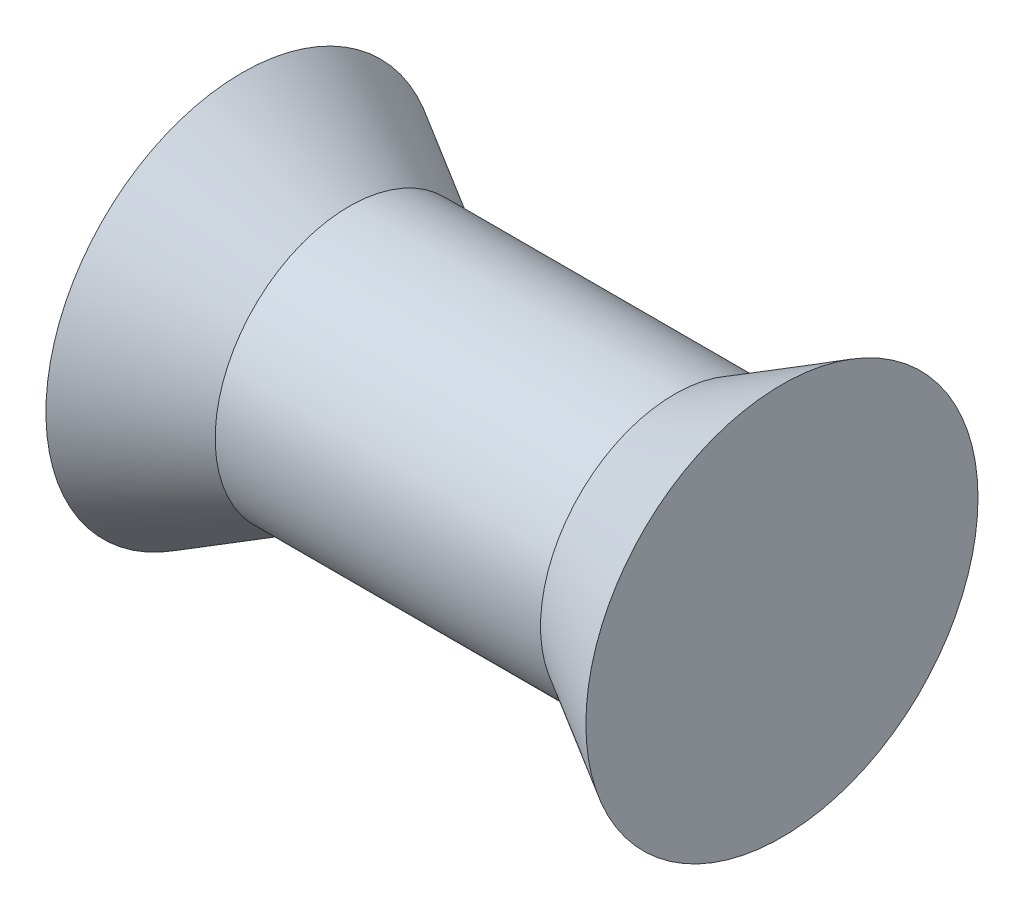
ISO-10303-21;
HEADER;
FILE_DESCRIPTION(('STEP AP214'),'2;1');
FILE_NAME('part.step','',(''),(''),'','','');
FILE_SCHEMA(('AUTOMOTIVE_DESIGN { 1 0 10303 214 1 1 1 1 }'));
ENDSEC;
DATA;
#1=APPLICATION_CONTEXT('core data for automotive mechanical design processes');
#2=APPLICATION_PROTOCOL_DEFINITION('international standard','automotive_design',2000,#1);
#3=PRODUCT_CONTEXT('',#1,'mechanical');
#4=PRODUCT('Part','Part','',(#3));
#5=PRODUCT_RELATED_PRODUCT_CATEGORY('part','',(#4));
#6=PRODUCT_DEFINITION_FORMATION('','',#4);
#7=PRODUCT_DEFINITION_CONTEXT('part definition',#1,'design');
#8=PRODUCT_DEFINITION('design','',#6,#7);
#9=PRODUCT_DEFINITION_SHAPE('','',#8);
#10=(LENGTH_UNIT() NAMED_UNIT(*) SI_UNIT(.MILLI.,.METRE.));
#11=(NAMED_UNIT(*) PLANE_ANGLE_UNIT() SI_UNIT($,.RADIAN.));
#12=(NAMED_UNIT(*) SI_UNIT($,.STERADIAN.) SOLID_ANGLE_UNIT());
#13=UNCERTAINTY_MEASURE_WITH_UNIT(LENGTH_MEASURE(1.E-05),#10,'distance_accuracy_value','');
#14=(GEOMETRIC_REPRESENTATION_CONTEXT(3) GLOBAL_UNCERTAINTY_ASSIGNED_CONTEXT((#13)) GLOBAL_UNIT_ASSIGNED_CONTEXT((#10,
#11,#12)) REPRESENTATION_CONTEXT('',''));
#15=CARTESIAN_POINT('',(0.,0.,0.));
#16=DIRECTION('',(0.,0.,1.));
#17=DIRECTION('',(1.,0.,0.));
#18=AXIS2_PLACEMENT_3D('',#15,#16,#17);
#19=CARTESIAN_POINT('',(0.,0.,0.));
#20=DIRECTION('',(1.,0.,0.));
#21=DIRECTION('',(0.,0.,-1.));
#22=AXIS2_PLACEMENT_3D('',#19,#20,#21);
#23=PLANE('',#22);
#24=CARTESIAN_POINT('',(0.,0.,0.));
#25=DIRECTION('',(1.,0.,0.));
#26=DIRECTION('',(0.,0.,-1.));
#27=AXIS2_PLACEMENT_3D('',#24,#25,#26);
#28=CIRCLE('',#27,2.87771120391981);
#29=CARTESIAN_POINT('',(0.,0.,-2.87771120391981));
#30=VERTEX_POINT('',#29);
#31=EDGE_CURVE('E10',#30,#30,#28,.T.);
#32=ORIENTED_EDGE('',*,*,#31,.T.);
#33=EDGE_LOOP('',(#32));
#34=FACE_BOUND('',#33,.T.);
#35=ADVANCED_FACE('F35',(#34),#23,.T.);
#36=CARTESIAN_POINT('',(0.,0.,0.));
#37=DIRECTION('',(1.,0.,0.));
#38=DIRECTION('',(0.,0.,-1.));
#39=AXIS2_PLACEMENT_3D('',#36,#37,#38);
#40=CONICAL_SURFACE('',#39,2.87771120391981,0.523598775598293);
#41=CARTESIAN_POINT('',(-1.5748,0.,0.));
#42=DIRECTION('',(1.,0.,0.));
#43=DIRECTION('',(0.,0.,-1.));
#44=AXIS2_PLACEMENT_3D('',#41,#42,#43);
#45=CIRCLE('',#44,1.9685);
#46=CARTESIAN_POINT('',(-1.5748,0.,-1.9685));
#47=VERTEX_POINT('',#46);
#48=EDGE_CURVE('E41',#47,#47,#45,.T.);
#49=ORIENTED_EDGE('',*,*,#48,.T.);
#50=EDGE_LOOP('',(#49));
#51=FACE_BOUND('',#50,.T.);
#52=ORIENTED_EDGE('',*,*,#31,.F.);
#53=EDGE_LOOP('',(#52));
#54=FACE_BOUND('',#53,.T.);
#55=ADVANCED_FACE('F67',(#51,#54),#40,.T.);
#56=CARTESIAN_POINT('',(0.,0.,0.));
#57=DIRECTION('',(1.,0.,0.));
#58=DIRECTION('',(0.,0.,-1.));
#59=AXIS2_PLACEMENT_3D('',#56,#57,#58);
#60=CYLINDRICAL_SURFACE('',#59,1.9685);
#61=CARTESIAN_POINT('',(-6.35000000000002,0.,0.));
#62=DIRECTION('',(1.,0.,0.));
#63=DIRECTION('',(0.,0.,-1.));
#64=AXIS2_PLACEMENT_3D('',#61,#62,#63);
#65=CIRCLE('',#64,1.9685);
#66=CARTESIAN_POINT('',(-6.35000000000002,0.,-1.9685));
#67=VERTEX_POINT('',#66);
#68=EDGE_CURVE('E45',#67,#67,#65,.T.);
#69=ORIENTED_EDGE('',*,*,#68,.T.);
#70=EDGE_LOOP('',(#69));
#71=FACE_BOUND('',#70,.T.);
#72=ORIENTED_EDGE('',*,*,#48,.F.);
#73=EDGE_LOOP('',(#72));
#74=FACE_BOUND('',#73,.T.);
#75=ADVANCED_FACE('F64',(#71,#74),#60,.T.);
#76=CARTESIAN_POINT('',(-6.35000000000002,0.,0.));
#77=DIRECTION('',(-1.,0.,0.));
#78=DIRECTION('',(0.,0.,1.));
#79=AXIS2_PLACEMENT_3D('',#76,#77,#78);
#80=CONICAL_SURFACE('',#79,1.9685,0.5235987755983);
#81=CARTESIAN_POINT('',(-7.9248,0.,0.));
#82=DIRECTION('',(1.,0.,0.));
#83=DIRECTION('',(0.,0.,-1.));
#84=AXIS2_PLACEMENT_3D('',#81,#82,#83);
#85=CIRCLE('',#84,2.87771120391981);
#86=CARTESIAN_POINT('',(-7.9248,0.,-2.87771120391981));
#87=VERTEX_POINT('',#86);
#88=EDGE_CURVE('E49',#87,#87,#85,.T.);
#89=ORIENTED_EDGE('',*,*,#88,.T.);
#90=EDGE_LOOP('',(#89));
#91=FACE_BOUND('',#90,.T.);
#92=ORIENTED_EDGE('',*,*,#68,.F.);
#93=EDGE_LOOP('',(#92));
#94=FACE_BOUND('',#93,.T.);
#95=ADVANCED_FACE('F55',(#91,#94),#80,.T.);
#96=CARTESIAN_POINT('',(-2.26429841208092,0.,0.));
#97=DIRECTION('',(1.,0.,0.));
#98=DIRECTION('',(0.,1.,0.));
#99=AXIS2_PLACEMENT_3D('',#96,#97,#98);
#100=SPHERICAL_SURFACE('',#99,6.35);
#101=ORIENTED_EDGE('',*,*,#88,.F.);
#102=EDGE_LOOP('',(#101));
#103=FACE_BOUND('',#102,.T.);
#104=ADVANCED_FACE('F58',(#103),#100,.T.);
#105=CLOSED_SHELL('',(#35,#55,#75,#95,#104));
#106=MANIFOLD_SOLID_BREP('B2',#105);
#107=ADVANCED_BREP_SHAPE_REPRESENTATION('',(#18,#106),#14);
#108=SHAPE_DEFINITION_REPRESENTATION(#9,#107);
ENDSEC;
END-ISO-10303-21;
